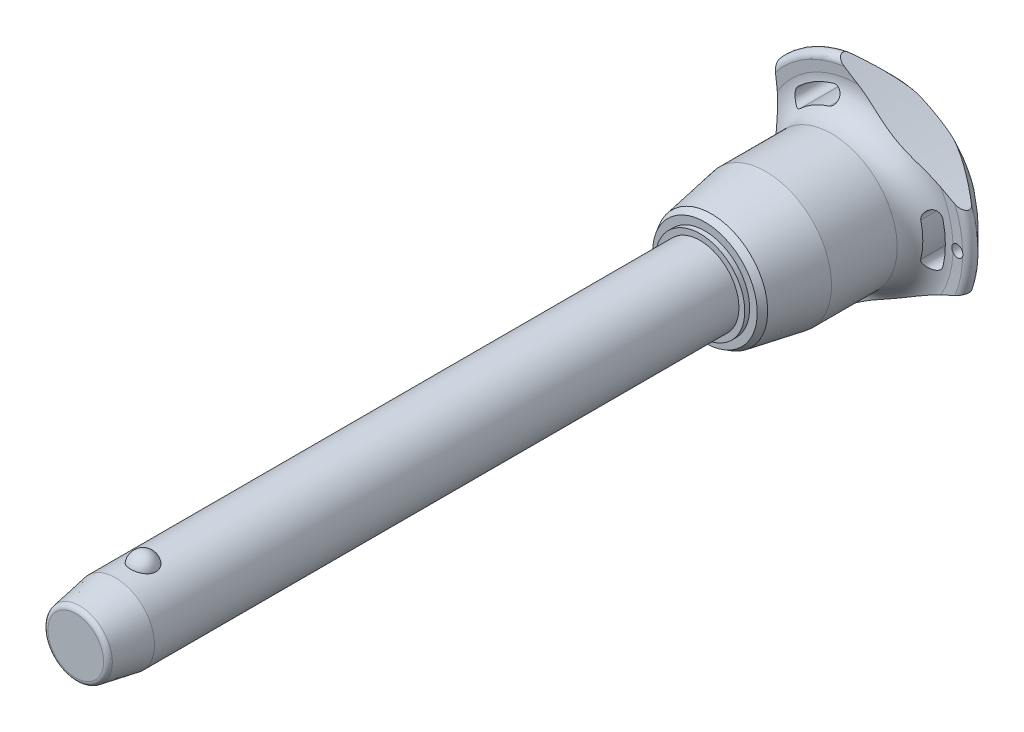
from build123d import *

# Parameters (mm, degrees)
SKETCH1_R           = 10
BOSS_EXTRUDE1_DEPTH = 140
SKETCH2_R           = 8.75
BOSS_EXTRUDE2_DEPTH = 50.7
BOSS_EXTRUDE3_START = 20.5
SKETCH1_2_R         = 10
BOSS_EXTRUDE3_DEPTH = 20.5
CHAMFER1_SIZE       = 10.25
CHAMFER1_SIZE2      = 1.807351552
FILLET1_R           = 1.25
SKETCH6_R           = 176.92625
CUT_EXTRUDE1_DEPTH  = 195.927884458
CIRPATTERN1_COUNT   = 3
SKETCH7_R           = 1.5
CUT_EXTRUDE2_DEPTH  = 195.849774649


with BuildPart() as part:
    # Sketch1 → Boss-Extrude1 (new body)
    with BuildSketch(Plane.XY):
        Circle(SKETCH1_R)
    extrude(amount=-BOSS_EXTRUDE1_DEPTH)

    # Sketch2 → Boss-Extrude2 (add)
    with BuildSketch(Plane(origin=(0, 0, -140), x_dir=(-1, 0, 0), z_dir=(0, 0, -1))):
        with Locations(Location((0, 0, 0), (0, 0, 180))):
            Circle(SKETCH2_R)
    extrude(amount=BOSS_EXTRUDE2_DEPTH)

    # Sketch3 → Revolve1 (revolve)
    with BuildSketch(Plane(origin=(0, 0, 0), x_dir=(0, 0, -1), z_dir=(1, 0, 0))):
        with BuildLine():
            Line((-3.201562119, 12.5), (-3.201562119, 5.9))
            ThreePointArc((-3.201562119, 5.9), (0.098437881, 9.2), (-3.201562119, 12.5))
        make_face()
        with BuildLine():
            Line((-3.201562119, -5.9), (-3.201562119, -12.5))
            ThreePointArc((-3.201562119, -12.5), (0.098437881, -9.2), (-3.201562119, -5.9))
        make_face()
    revolve(axis=Axis((0, -5.9, 3.201562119), (0, 1, 0)))

    # Sketch1_2 → Boss-Extrude3 (add)
    with BuildSketch(Plane.XY.offset(BOSS_EXTRUDE3_START)):
        Circle(SKETCH1_2_R)
    extrude(amount=-BOSS_EXTRUDE3_DEPTH)

    # Chamfer1
    chamfer1_edges = [part.edges().sort_by_distance(p)[0] for p in [
        (-10, 0, 20.5),
    ]]
    chamfer1_side = [part.faces().sort_by_distance(p)[0] for p in [
        (-10, 0, -59.75),
    ]]
    chamfer(chamfer1_edges, length=CHAMFER1_SIZE, length2=CHAMFER1_SIZE2, reference=chamfer1_side[0])

    # Fillet1
    fillet1_edges = [part.edges().sort_by_distance(p)[0] for p in [
        (-8.192648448, 0, 20.5),
        (-8.75, 0, -190.7),
    ]]
    fillet(fillet1_edges, radius=FILLET1_R)

    # Sketch4 → Revolve2 (revolve)
    with BuildSketch(Plane(origin=(0, 0, 0), x_dir=(0, 0, -1), z_dir=(1, 0, 0)), mode=Mode.PRIVATE) as revolve2_sk:
        Polygon((140, 0), (140, 11.504815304), (141.25, 11.504815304), (141.25, 13.461079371), (142.944174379, 14.439211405), (156.9, 16.9), (173.8, 16.9), (173.8, 0), align=None)
    revolve(revolve2_sk.sketch.rotate(Axis((0, 0, -173.8), (0, 0, 1)), 90), axis=Axis((0, 0, -173.8), (0, 0, 1)))

    # Sketch5 → Revolve3 (revolve)
    with BuildSketch(Plane(origin=(0, 0, 0), x_dir=(0, 0, -1), z_dir=(1, 0, 0)), mode=Mode.PRIVATE) as revolve3_sk:
        with BuildLine():
            Line((180.790129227, 24.271609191), (180.652256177, 26.865060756))
            ThreePointArc((180.652256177, 26.865060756), (181.598671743, 28.411427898), (183.38137085, 28.08137085))
            Line((183.38137085, 28.08137085), (189.763226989, 21.69951471))
            ThreePointArc((189.763226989, 21.69951471), (190.7, 19.381044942), (189.683055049, 17.096604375))
            ThreePointArc((189.683055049, 17.096604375), (184.18864484, 9.321268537), (182.25, 0))
            Line((182.25, 0), (173.8, 0))
            Line((173.8, 0), (173.8, 16.9))
            ThreePointArc((173.8, 16.9), (178.879432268, 19.083427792), (180.790129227, 24.271609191))
        make_face()
    revolve(revolve3_sk.sketch.rotate(Axis((0, 0, -182.25), (0, 0, 1)), 90), axis=Axis((0, 0, -182.25), (0, 0, 1)))

    # Sketch6 → Cut-Extrude1 (cut, through all)
    with BuildSketch(Plane.XY):
        with Locations((-197.42625, 0)):
            Circle(SKETCH6_R)
        with BuildLine():
            ThreePointArc((21.802992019, -5.260839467), (22.428706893, 0), (21.802992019, 5.260839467))
            ThreePointArc((21.802992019, 5.260839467), (19.579234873, 6.620060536), (18.220013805, 4.39630339))
            ThreePointArc((18.220013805, 4.39630339), (18.742902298, 0), (18.220013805, -4.39630339))
            ThreePointArc((18.220013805, -4.39630339), (19.579234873, -6.620060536), (21.802992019, -5.260839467))
        make_face()
    cut_extrude1 = extrude(amount=-CUT_EXTRUDE1_DEPTH, mode=Mode.SUBTRACT)

    # CirPattern1: Cut-Extrude1 ×3 about axis
    cirpattern1_axis = Axis((0, 0, 0), (0, 0, 1))
    for i in range(1, CIRPATTERN1_COUNT):
        add(cut_extrude1.rotate(cirpattern1_axis, i * 360 / CIRPATTERN1_COUNT), mode=Mode.SUBTRACT)

    # Sketch7 → Cut-Extrude2 (cut, through all)
    with BuildSketch(Plane.XY):
        with Locations(Location((25.428706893, 0, 0), (0, 0, 17.230769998))):
            Circle(SKETCH7_R)
    extrude(amount=-CUT_EXTRUDE2_DEPTH, mode=Mode.SUBTRACT)


solid = part.part
